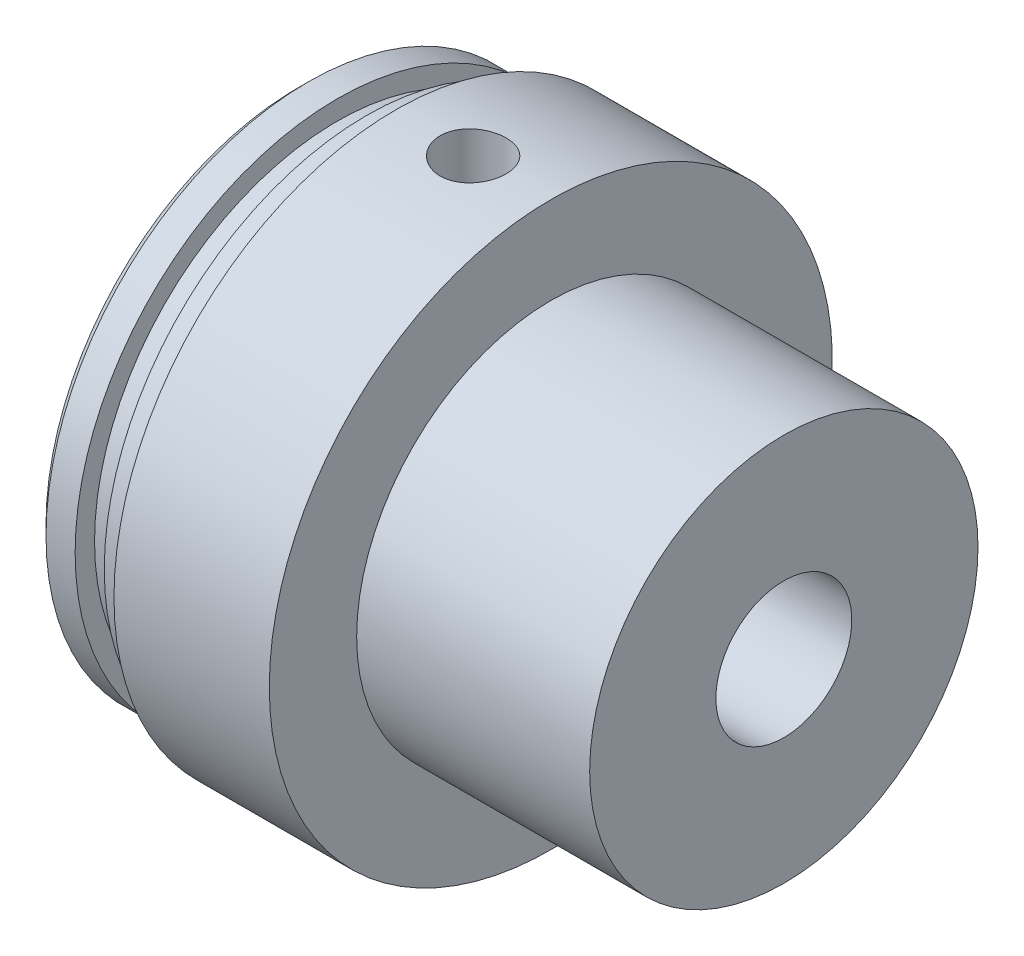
from build123d import *

# Parameters (mm, degrees)
CHANFREIN1_SIZE       = 1
TROU_TARAUD_M82_D     = 6.8
TROU_TARAUD_M82_DEPTH = 20
TROU_TARAUD_M82_TIP   = 2.042926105
D_GAGEMENT_M51_D      = 5.5
D_GAGEMENT_M51_DEPTH  = 22
D_GAGEMENT_M51_TIP    = 1.652366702


with BuildPart() as part:
    # Esquisse1 → R_volution1 (revolve)
    with BuildSketch(Plane.XY, mode=Mode.PRIVATE) as r_volution1_sk:
        Polygon((0, 7), (0, 27), (4, 27), (4, 25), (7, 25), (7, 27), (10, 27), (10, 29), (26, 29), (26, 20), (50, 20), (50, 7), align=None)
    revolve(r_volution1_sk.sketch.rotate(Axis((-46.067916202, 0, 0), (1, 0, 0)), 90), axis=Axis((-46.067916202, 0, 0), (1, 0, 0)))

    # Chanfrein1
    chanfrein1_edges = [part.edges().sort_by_distance(p)[0] for p in [
        (0, 0, -27),
    ]]
    chamfer(chanfrein1_edges, length=CHANFREIN1_SIZE)

    # Trou taraud_ M82
    with Locations(Plane(origin=(18, 29, 0), x_dir=(0, 0, 1), z_dir=(0, 1, 0))):
        with Locations((0, 0)):
            Hole(TROU_TARAUD_M82_D / 2, depth=TROU_TARAUD_M82_DEPTH)
            with Locations((0, 0, -(TROU_TARAUD_M82_DEPTH + TROU_TARAUD_M82_TIP / 2))):  # 118° drill point
                Cone(0, TROU_TARAUD_M82_D / 2, TROU_TARAUD_M82_TIP, mode=Mode.SUBTRACT)

    # D_gagement M51
    with Locations(Plane.ZY):
        with Locations((0, 12)):
            Hole(D_GAGEMENT_M51_D / 2, depth=D_GAGEMENT_M51_DEPTH)
            with Locations((0, 0, -(D_GAGEMENT_M51_DEPTH + D_GAGEMENT_M51_TIP / 2))):  # 118° drill point
                Cone(0, D_GAGEMENT_M51_D / 2, D_GAGEMENT_M51_TIP, mode=Mode.SUBTRACT)


solid = part.part
